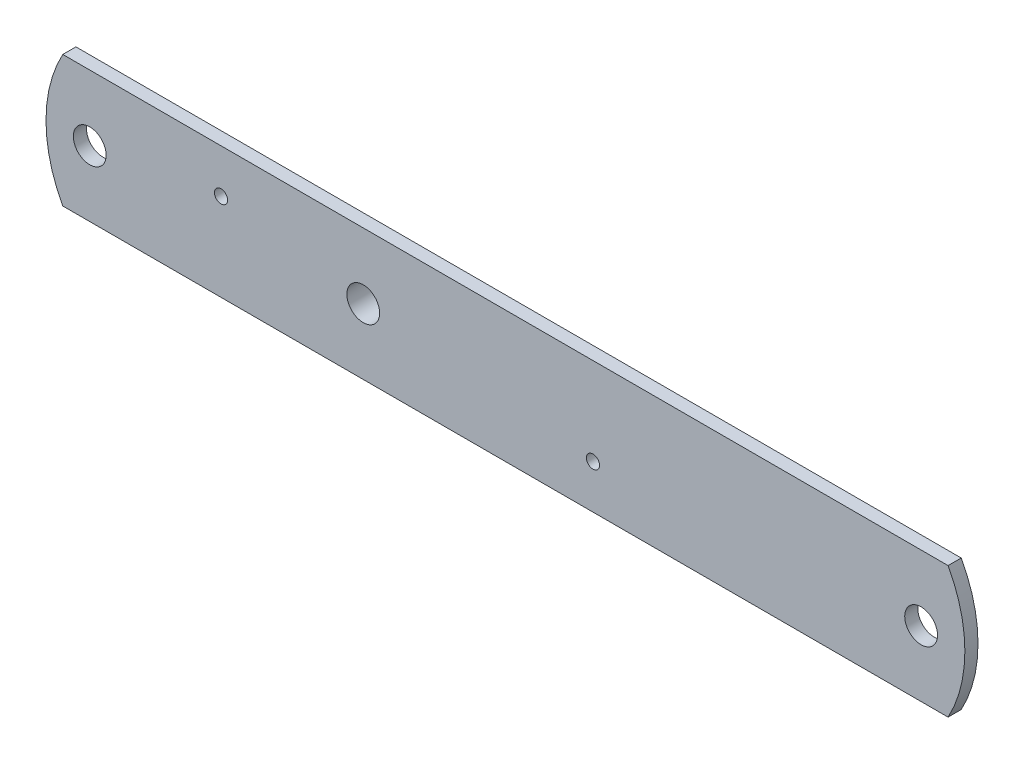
ISO-10303-21;
HEADER;
FILE_DESCRIPTION(('STEP AP214'),'2;1');
FILE_NAME('part.step','',(''),(''),'','','');
FILE_SCHEMA(('AUTOMOTIVE_DESIGN { 1 0 10303 214 1 1 1 1 }'));
ENDSEC;
DATA;
#1=APPLICATION_CONTEXT('core data for automotive mechanical design processes');
#2=APPLICATION_PROTOCOL_DEFINITION('international standard','automotive_design',2000,#1);
#3=PRODUCT_CONTEXT('',#1,'mechanical');
#4=PRODUCT('Part','Part','',(#3));
#5=PRODUCT_RELATED_PRODUCT_CATEGORY('part','',(#4));
#6=PRODUCT_DEFINITION_FORMATION('','',#4);
#7=PRODUCT_DEFINITION_CONTEXT('part definition',#1,'design');
#8=PRODUCT_DEFINITION('design','',#6,#7);
#9=PRODUCT_DEFINITION_SHAPE('','',#8);
#10=(LENGTH_UNIT() NAMED_UNIT(*) SI_UNIT(.MILLI.,.METRE.));
#11=(NAMED_UNIT(*) PLANE_ANGLE_UNIT() SI_UNIT($,.RADIAN.));
#12=(NAMED_UNIT(*) SI_UNIT($,.STERADIAN.) SOLID_ANGLE_UNIT());
#13=UNCERTAINTY_MEASURE_WITH_UNIT(LENGTH_MEASURE(1.E-05),#10,'distance_accuracy_value','');
#14=(GEOMETRIC_REPRESENTATION_CONTEXT(3) GLOBAL_UNCERTAINTY_ASSIGNED_CONTEXT((#13)) GLOBAL_UNIT_ASSIGNED_CONTEXT((#10,
#11,#12)) REPRESENTATION_CONTEXT('',''));
#15=CARTESIAN_POINT('',(0.,0.,0.));
#16=DIRECTION('',(0.,0.,1.));
#17=DIRECTION('',(1.,0.,0.));
#18=AXIS2_PLACEMENT_3D('',#15,#16,#17);
#19=CARTESIAN_POINT('',(125.,-59.9999999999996,0.));
#20=DIRECTION('',(0.,0.,1.));
#21=DIRECTION('',(1.,0.,0.));
#22=AXIS2_PLACEMENT_3D('',#19,#20,#21);
#23=PLANE('',#22);
#24=CARTESIAN_POINT('',(500.,-80.0000000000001,0.));
#25=DIRECTION('',(0.,0.,1.));
#26=DIRECTION('',(1.,0.,0.));
#27=AXIS2_PLACEMENT_3D('',#24,#25,#26);
#28=CIRCLE('',#27,5.99999999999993);
#29=CARTESIAN_POINT('',(494.,-80.0000000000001,0.));
#30=VERTEX_POINT('',#29);
#31=EDGE_CURVE('E127',#30,#30,#28,.T.);
#32=ORIENTED_EDGE('',*,*,#31,.T.);
#33=EDGE_LOOP('',(#32));
#34=FACE_BOUND('',#33,.T.);
#35=CARTESIAN_POINT('',(39.9999999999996,-59.9999999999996,0.));
#36=DIRECTION('',(0.,0.,1.));
#37=DIRECTION('',(1.,0.,0.));
#38=AXIS2_PLACEMENT_3D('',#35,#36,#37);
#39=CIRCLE('',#38,15.);
#40=CARTESIAN_POINT('',(24.9999999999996,-59.9999999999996,0.));
#41=VERTEX_POINT('',#40);
#42=EDGE_CURVE('E148',#41,#41,#39,.T.);
#43=ORIENTED_EDGE('',*,*,#42,.T.);
#44=EDGE_LOOP('',(#43));
#45=FACE_BOUND('',#44,.T.);
#46=CARTESIAN_POINT('',(125.,-59.9999999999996,0.));
#47=DIRECTION('',(0.,0.,1.));
#48=DIRECTION('',(1.,0.,0.));
#49=AXIS2_PLACEMENT_3D('',#46,#47,#48);
#50=CIRCLE('',#49,125.);
#51=CARTESIAN_POINT('',(15.3414390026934,0.,0.));
#52=VERTEX_POINT('',#51);
#53=CARTESIAN_POINT('',(15.3414390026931,-120.000000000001,0.));
#54=VERTEX_POINT('',#53);
#55=EDGE_CURVE('E154',#52,#54,#50,.T.);
#56=ORIENTED_EDGE('',*,*,#55,.F.);
#57=DIRECTION('',(-1.,0.,0.));
#58=VECTOR('',#57,1.);
#59=CARTESIAN_POINT('',(15.3414390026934,0.,0.));
#60=LINE('',#59,#58);
#61=CARTESIAN_POINT('',(824.658560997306,0.,0.));
#62=VERTEX_POINT('',#61);
#63=EDGE_CURVE('E161',#62,#52,#60,.T.);
#64=ORIENTED_EDGE('',*,*,#63,.F.);
#65=CARTESIAN_POINT('',(715.,-59.9999999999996,0.));
#66=DIRECTION('',(0.,0.,1.));
#67=DIRECTION('',(1.,0.,0.));
#68=AXIS2_PLACEMENT_3D('',#65,#66,#67);
#69=CIRCLE('',#68,125.);
#70=CARTESIAN_POINT('',(824.658560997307,-120.,0.));
#71=VERTEX_POINT('',#70);
#72=EDGE_CURVE('E159',#71,#62,#69,.T.);
#73=ORIENTED_EDGE('',*,*,#72,.F.);
#74=DIRECTION('',(1.,0.,0.));
#75=VECTOR('',#74,1.);
#76=CARTESIAN_POINT('',(15.3414390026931,-120.000000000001,0.));
#77=LINE('',#76,#75);
#78=EDGE_CURVE('E157',#54,#71,#77,.T.);
#79=ORIENTED_EDGE('',*,*,#78,.F.);
#80=EDGE_LOOP('',(#56,#64,#73,#79));
#81=FACE_BOUND('',#80,.T.);
#82=CARTESIAN_POINT('',(160.,-40.,0.));
#83=DIRECTION('',(0.,0.,1.));
#84=DIRECTION('',(1.,0.,0.));
#85=AXIS2_PLACEMENT_3D('',#82,#83,#84);
#86=CIRCLE('',#85,6.00000000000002);
#87=CARTESIAN_POINT('',(154.,-40.,0.));
#88=VERTEX_POINT('',#87);
#89=EDGE_CURVE('E142',#88,#88,#86,.T.);
#90=ORIENTED_EDGE('',*,*,#89,.T.);
#91=EDGE_LOOP('',(#90));
#92=FACE_BOUND('',#91,.T.);
#93=CARTESIAN_POINT('',(800.,-59.9999999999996,0.));
#94=DIRECTION('',(0.,0.,1.));
#95=DIRECTION('',(1.,0.,0.));
#96=AXIS2_PLACEMENT_3D('',#93,#94,#95);
#97=CIRCLE('',#96,15.);
#98=CARTESIAN_POINT('',(785.,-59.9999999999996,0.));
#99=VERTEX_POINT('',#98);
#100=EDGE_CURVE('E133',#99,#99,#97,.T.);
#101=ORIENTED_EDGE('',*,*,#100,.T.);
#102=EDGE_LOOP('',(#101));
#103=FACE_BOUND('',#102,.T.);
#104=DIRECTION('',(0.,-1.,0.));
#105=VECTOR('',#104,1.);
#106=CARTESIAN_POINT('',(340.,-30.0000000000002,0.));
#107=LINE('',#106,#105);
#108=CARTESIAN_POINT('',(340.,-30.0000000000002,0.));
#109=VERTEX_POINT('',#108);
#110=CARTESIAN_POINT('',(340.,-90.0000000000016,0.));
#111=VERTEX_POINT('',#110);
#112=EDGE_CURVE('E94',#109,#111,#107,.T.);
#113=ORIENTED_EDGE('',*,*,#112,.F.);
#114=DIRECTION('',(1.,0.,0.));
#115=VECTOR('',#114,1.);
#116=CARTESIAN_POINT('',(340.,-30.0000000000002,0.));
#117=LINE('',#116,#115);
#118=CARTESIAN_POINT('',(240.,-30.0000000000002,0.));
#119=VERTEX_POINT('',#118);
#120=EDGE_CURVE('E96',#119,#109,#117,.T.);
#121=ORIENTED_EDGE('',*,*,#120,.F.);
#122=DIRECTION('',(0.,1.,0.));
#123=VECTOR('',#122,1.);
#124=CARTESIAN_POINT('',(240.,-30.0000000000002,0.));
#125=LINE('',#124,#123);
#126=CARTESIAN_POINT('',(240.,-90.0000000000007,0.));
#127=VERTEX_POINT('',#126);
#128=EDGE_CURVE('E53',#127,#119,#125,.T.);
#129=ORIENTED_EDGE('',*,*,#128,.F.);
#130=DIRECTION('',(-1.,0.,0.));
#131=VECTOR('',#130,1.);
#132=CARTESIAN_POINT('',(340.,-90.0000000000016,0.));
#133=LINE('',#132,#131);
#134=EDGE_CURVE('E48',#111,#127,#133,.T.);
#135=ORIENTED_EDGE('',*,*,#134,.F.);
#136=EDGE_LOOP('',(#113,#121,#129,#135));
#137=FACE_BOUND('',#136,.T.);
#138=ADVANCED_FACE('F33',(#34,#45,#81,#92,#103,#137),#23,.F.);
#139=CARTESIAN_POINT('',(125.,-59.9999999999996,12.));
#140=DIRECTION('',(0.,0.,1.));
#141=DIRECTION('',(1.,0.,0.));
#142=AXIS2_PLACEMENT_3D('',#139,#140,#141);
#143=PLANE('',#142);
#144=CARTESIAN_POINT('',(800.,-59.9999999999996,12.));
#145=DIRECTION('',(0.,0.,1.));
#146=DIRECTION('',(1.,0.,0.));
#147=AXIS2_PLACEMENT_3D('',#144,#145,#146);
#148=CIRCLE('',#147,15.);
#149=CARTESIAN_POINT('',(785.,-59.9999999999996,12.));
#150=VERTEX_POINT('',#149);
#151=EDGE_CURVE('E136',#150,#150,#148,.T.);
#152=ORIENTED_EDGE('',*,*,#151,.F.);
#153=EDGE_LOOP('',(#152));
#154=FACE_BOUND('',#153,.T.);
#155=CARTESIAN_POINT('',(160.,-40.,12.));
#156=DIRECTION('',(0.,0.,1.));
#157=DIRECTION('',(1.,0.,0.));
#158=AXIS2_PLACEMENT_3D('',#155,#156,#157);
#159=CIRCLE('',#158,6.00000000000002);
#160=CARTESIAN_POINT('',(154.,-40.,12.));
#161=VERTEX_POINT('',#160);
#162=EDGE_CURVE('E145',#161,#161,#159,.T.);
#163=ORIENTED_EDGE('',*,*,#162,.F.);
#164=EDGE_LOOP('',(#163));
#165=FACE_BOUND('',#164,.T.);
#166=CARTESIAN_POINT('',(125.,-59.9999999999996,12.));
#167=DIRECTION('',(0.,0.,1.));
#168=DIRECTION('',(1.,0.,0.));
#169=AXIS2_PLACEMENT_3D('',#166,#167,#168);
#170=CIRCLE('',#169,125.);
#171=CARTESIAN_POINT('',(15.3414390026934,0.,12.));
#172=VERTEX_POINT('',#171);
#173=CARTESIAN_POINT('',(15.3414390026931,-120.000000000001,12.));
#174=VERTEX_POINT('',#173);
#175=EDGE_CURVE('E163',#172,#174,#170,.T.);
#176=ORIENTED_EDGE('',*,*,#175,.T.);
#177=DIRECTION('',(1.,0.,0.));
#178=VECTOR('',#177,1.);
#179=CARTESIAN_POINT('',(15.3414390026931,-120.000000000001,12.));
#180=LINE('',#179,#178);
#181=CARTESIAN_POINT('',(824.658560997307,-120.,12.));
#182=VERTEX_POINT('',#181);
#183=EDGE_CURVE('E166',#174,#182,#180,.T.);
#184=ORIENTED_EDGE('',*,*,#183,.T.);
#185=CARTESIAN_POINT('',(715.,-59.9999999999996,12.));
#186=DIRECTION('',(0.,0.,1.));
#187=DIRECTION('',(1.,0.,0.));
#188=AXIS2_PLACEMENT_3D('',#185,#186,#187);
#189=CIRCLE('',#188,125.);
#190=CARTESIAN_POINT('',(824.658560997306,0.,12.));
#191=VERTEX_POINT('',#190);
#192=EDGE_CURVE('E168',#182,#191,#189,.T.);
#193=ORIENTED_EDGE('',*,*,#192,.T.);
#194=DIRECTION('',(-1.,0.,0.));
#195=VECTOR('',#194,1.);
#196=CARTESIAN_POINT('',(15.3414390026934,0.,12.));
#197=LINE('',#196,#195);
#198=EDGE_CURVE('E170',#191,#172,#197,.T.);
#199=ORIENTED_EDGE('',*,*,#198,.T.);
#200=EDGE_LOOP('',(#176,#184,#193,#199));
#201=FACE_BOUND('',#200,.T.);
#202=CARTESIAN_POINT('',(39.9999999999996,-59.9999999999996,12.));
#203=DIRECTION('',(0.,0.,1.));
#204=DIRECTION('',(1.,0.,0.));
#205=AXIS2_PLACEMENT_3D('',#202,#203,#204);
#206=CIRCLE('',#205,15.);
#207=CARTESIAN_POINT('',(24.9999999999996,-59.9999999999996,12.));
#208=VERTEX_POINT('',#207);
#209=EDGE_CURVE('E151',#208,#208,#206,.T.);
#210=ORIENTED_EDGE('',*,*,#209,.F.);
#211=EDGE_LOOP('',(#210));
#212=FACE_BOUND('',#211,.T.);
#213=CARTESIAN_POINT('',(290.,-59.9999999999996,12.));
#214=DIRECTION('',(0.,0.,1.));
#215=DIRECTION('',(1.,0.,0.));
#216=AXIS2_PLACEMENT_3D('',#213,#214,#215);
#217=CIRCLE('',#216,15.);
#218=CARTESIAN_POINT('',(275.,-59.9999999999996,12.));
#219=VERTEX_POINT('',#218);
#220=EDGE_CURVE('E139',#219,#219,#217,.T.);
#221=ORIENTED_EDGE('',*,*,#220,.F.);
#222=EDGE_LOOP('',(#221));
#223=FACE_BOUND('',#222,.T.);
#224=CARTESIAN_POINT('',(500.,-80.0000000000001,12.));
#225=DIRECTION('',(0.,0.,1.));
#226=DIRECTION('',(1.,0.,0.));
#227=AXIS2_PLACEMENT_3D('',#224,#225,#226);
#228=CIRCLE('',#227,5.99999999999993);
#229=CARTESIAN_POINT('',(494.,-80.0000000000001,12.));
#230=VERTEX_POINT('',#229);
#231=EDGE_CURVE('E130',#230,#230,#228,.T.);
#232=ORIENTED_EDGE('',*,*,#231,.F.);
#233=EDGE_LOOP('',(#232));
#234=FACE_BOUND('',#233,.T.);
#235=ADVANCED_FACE('F197',(#154,#165,#201,#212,#223,#234),#143,.T.);
#236=CARTESIAN_POINT('',(125.,-59.9999999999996,12.));
#237=DIRECTION('',(0.,0.,-1.));
#238=DIRECTION('',(-1.,0.,0.));
#239=AXIS2_PLACEMENT_3D('',#236,#237,#238);
#240=CYLINDRICAL_SURFACE('',#239,125.);
#241=ORIENTED_EDGE('',*,*,#55,.T.);
#242=DIRECTION('',(0.,0.,-1.));
#243=VECTOR('',#242,1.);
#244=CARTESIAN_POINT('',(15.3414390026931,-120.000000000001,12.));
#245=LINE('',#244,#243);
#246=EDGE_CURVE('E11',#174,#54,#245,.T.);
#247=ORIENTED_EDGE('',*,*,#246,.F.);
#248=ORIENTED_EDGE('',*,*,#175,.F.);
#249=DIRECTION('',(0.,0.,-1.));
#250=VECTOR('',#249,1.);
#251=CARTESIAN_POINT('',(15.3414390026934,0.,12.));
#252=LINE('',#251,#250);
#253=EDGE_CURVE('E172',#172,#52,#252,.T.);
#254=ORIENTED_EDGE('',*,*,#253,.T.);
#255=EDGE_LOOP('',(#241,#247,#248,#254));
#256=FACE_BOUND('',#255,.T.);
#257=ADVANCED_FACE('F35',(#256),#240,.T.);
#258=CARTESIAN_POINT('',(15.3414390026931,-120.000000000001,12.));
#259=DIRECTION('',(0.,1.,0.));
#260=DIRECTION('',(0.,0.,1.));
#261=AXIS2_PLACEMENT_3D('',#258,#259,#260);
#262=PLANE('',#261);
#263=ORIENTED_EDGE('',*,*,#78,.T.);
#264=DIRECTION('',(0.,0.,-1.));
#265=VECTOR('',#264,1.);
#266=CARTESIAN_POINT('',(824.658560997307,-120.,12.));
#267=LINE('',#266,#265);
#268=EDGE_CURVE('E41',#182,#71,#267,.T.);
#269=ORIENTED_EDGE('',*,*,#268,.F.);
#270=ORIENTED_EDGE('',*,*,#183,.F.);
#271=ORIENTED_EDGE('',*,*,#246,.T.);
#272=EDGE_LOOP('',(#263,#269,#270,#271));
#273=FACE_BOUND('',#272,.T.);
#274=ADVANCED_FACE('F199',(#273),#262,.F.);
#275=CARTESIAN_POINT('',(715.,-59.9999999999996,12.));
#276=DIRECTION('',(0.,0.,-1.));
#277=DIRECTION('',(-1.,0.,0.));
#278=AXIS2_PLACEMENT_3D('',#275,#276,#277);
#279=CYLINDRICAL_SURFACE('',#278,125.);
#280=ORIENTED_EDGE('',*,*,#72,.T.);
#281=DIRECTION('',(0.,0.,-1.));
#282=VECTOR('',#281,1.);
#283=CARTESIAN_POINT('',(824.658560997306,0.,12.));
#284=LINE('',#283,#282);
#285=EDGE_CURVE('E175',#191,#62,#284,.T.);
#286=ORIENTED_EDGE('',*,*,#285,.F.);
#287=ORIENTED_EDGE('',*,*,#192,.F.);
#288=ORIENTED_EDGE('',*,*,#268,.T.);
#289=EDGE_LOOP('',(#280,#286,#287,#288));
#290=FACE_BOUND('',#289,.T.);
#291=ADVANCED_FACE('F182',(#290),#279,.T.);
#292=CARTESIAN_POINT('',(15.3414390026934,0.,12.));
#293=DIRECTION('',(0.,-1.,0.));
#294=DIRECTION('',(0.,0.,-1.));
#295=AXIS2_PLACEMENT_3D('',#292,#293,#294);
#296=PLANE('',#295);
#297=ORIENTED_EDGE('',*,*,#63,.T.);
#298=ORIENTED_EDGE('',*,*,#253,.F.);
#299=ORIENTED_EDGE('',*,*,#198,.F.);
#300=ORIENTED_EDGE('',*,*,#285,.T.);
#301=EDGE_LOOP('',(#297,#298,#299,#300));
#302=FACE_BOUND('',#301,.T.);
#303=ADVANCED_FACE('F191',(#302),#296,.F.);
#304=CARTESIAN_POINT('',(39.9999999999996,-59.9999999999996,12.));
#305=DIRECTION('',(0.,0.,-1.));
#306=DIRECTION('',(-1.,0.,0.));
#307=AXIS2_PLACEMENT_3D('',#304,#305,#306);
#308=CYLINDRICAL_SURFACE('',#307,15.);
#309=CARTESIAN_POINT('',(24.9999999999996,-59.9999999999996,12.));
#310=CARTESIAN_POINT('',(24.9999999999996,-59.9999999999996,11.875));
#311=CARTESIAN_POINT('',(24.9999999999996,-59.9999999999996,11.75));
#312=CARTESIAN_POINT('',(24.9999999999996,-59.9999999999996,11.5));
#313=CARTESIAN_POINT('',(24.9999999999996,-59.9999999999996,11.375));
#314=CARTESIAN_POINT('',(24.9999999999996,-59.9999999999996,11.125));
#315=CARTESIAN_POINT('',(24.9999999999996,-59.9999999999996,11.));
#316=CARTESIAN_POINT('',(24.9999999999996,-59.9999999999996,10.75));
#317=CARTESIAN_POINT('',(24.9999999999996,-59.9999999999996,10.625));
#318=CARTESIAN_POINT('',(24.9999999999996,-59.9999999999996,10.375));
#319=CARTESIAN_POINT('',(24.9999999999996,-59.9999999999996,10.25));
#320=CARTESIAN_POINT('',(24.9999999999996,-59.9999999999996,9.99999999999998));
#321=CARTESIAN_POINT('',(24.9999999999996,-59.9999999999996,9.87499999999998));
#322=CARTESIAN_POINT('',(24.9999999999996,-59.9999999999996,9.62499999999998));
#323=CARTESIAN_POINT('',(24.9999999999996,-59.9999999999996,9.49999999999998));
#324=CARTESIAN_POINT('',(24.9999999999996,-59.9999999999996,9.24999999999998));
#325=CARTESIAN_POINT('',(24.9999999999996,-59.9999999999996,9.12499999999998));
#326=CARTESIAN_POINT('',(24.9999999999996,-59.9999999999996,8.87499999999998));
#327=CARTESIAN_POINT('',(24.9999999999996,-59.9999999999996,8.74999999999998));
#328=CARTESIAN_POINT('',(24.9999999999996,-59.9999999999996,8.49999999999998));
#329=CARTESIAN_POINT('',(24.9999999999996,-59.9999999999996,8.37499999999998));
#330=CARTESIAN_POINT('',(24.9999999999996,-59.9999999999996,8.12499999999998));
#331=CARTESIAN_POINT('',(24.9999999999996,-59.9999999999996,7.99999999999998));
#332=CARTESIAN_POINT('',(24.9999999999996,-59.9999999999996,7.74999999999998));
#333=CARTESIAN_POINT('',(24.9999999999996,-59.9999999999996,7.62499999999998));
#334=CARTESIAN_POINT('',(24.9999999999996,-59.9999999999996,7.37499999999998));
#335=CARTESIAN_POINT('',(24.9999999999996,-59.9999999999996,7.24999999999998));
#336=CARTESIAN_POINT('',(24.9999999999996,-59.9999999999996,6.99999999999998));
#337=CARTESIAN_POINT('',(24.9999999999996,-59.9999999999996,6.87499999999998));
#338=CARTESIAN_POINT('',(24.9999999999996,-59.9999999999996,6.62499999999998));
#339=CARTESIAN_POINT('',(24.9999999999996,-59.9999999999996,6.49999999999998));
#340=CARTESIAN_POINT('',(24.9999999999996,-59.9999999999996,6.24999999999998));
#341=CARTESIAN_POINT('',(24.9999999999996,-59.9999999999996,6.12499999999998));
#342=CARTESIAN_POINT('',(24.9999999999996,-59.9999999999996,5.87499999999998));
#343=CARTESIAN_POINT('',(24.9999999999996,-59.9999999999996,5.74999999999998));
#344=CARTESIAN_POINT('',(24.9999999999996,-59.9999999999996,5.49999999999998));
#345=CARTESIAN_POINT('',(24.9999999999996,-59.9999999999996,5.37499999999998));
#346=CARTESIAN_POINT('',(24.9999999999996,-59.9999999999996,5.12499999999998));
#347=CARTESIAN_POINT('',(24.9999999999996,-59.9999999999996,4.99999999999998));
#348=CARTESIAN_POINT('',(24.9999999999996,-59.9999999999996,4.74999999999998));
#349=CARTESIAN_POINT('',(24.9999999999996,-59.9999999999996,4.62499999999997));
#350=CARTESIAN_POINT('',(24.9999999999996,-59.9999999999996,4.37499999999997));
#351=CARTESIAN_POINT('',(24.9999999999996,-59.9999999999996,4.24999999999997));
#352=CARTESIAN_POINT('',(24.9999999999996,-59.9999999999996,3.99999999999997));
#353=CARTESIAN_POINT('',(24.9999999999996,-59.9999999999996,3.87499999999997));
#354=CARTESIAN_POINT('',(24.9999999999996,-59.9999999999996,3.62499999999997));
#355=CARTESIAN_POINT('',(24.9999999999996,-59.9999999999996,3.49999999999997));
#356=CARTESIAN_POINT('',(24.9999999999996,-59.9999999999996,3.24999999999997));
#357=CARTESIAN_POINT('',(24.9999999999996,-59.9999999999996,3.12499999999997));
#358=CARTESIAN_POINT('',(24.9999999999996,-59.9999999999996,2.87499999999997));
#359=CARTESIAN_POINT('',(24.9999999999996,-59.9999999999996,2.74999999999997));
#360=CARTESIAN_POINT('',(24.9999999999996,-59.9999999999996,2.49999999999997));
#361=CARTESIAN_POINT('',(24.9999999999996,-59.9999999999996,2.37499999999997));
#362=CARTESIAN_POINT('',(24.9999999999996,-59.9999999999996,2.12499999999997));
#363=CARTESIAN_POINT('',(24.9999999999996,-59.9999999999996,1.99999999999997));
#364=CARTESIAN_POINT('',(24.9999999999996,-59.9999999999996,1.74999999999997));
#365=CARTESIAN_POINT('',(24.9999999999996,-59.9999999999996,1.62499999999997));
#366=CARTESIAN_POINT('',(24.9999999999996,-59.9999999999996,1.37499999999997));
#367=CARTESIAN_POINT('',(24.9999999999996,-59.9999999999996,1.24999999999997));
#368=CARTESIAN_POINT('',(24.9999999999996,-59.9999999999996,0.999999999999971));
#369=CARTESIAN_POINT('',(24.9999999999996,-59.9999999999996,0.874999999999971));
#370=CARTESIAN_POINT('',(24.9999999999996,-59.9999999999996,0.624999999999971));
#371=CARTESIAN_POINT('',(24.9999999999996,-59.9999999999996,0.499999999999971));
#372=CARTESIAN_POINT('',(24.9999999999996,-59.9999999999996,0.249999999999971));
#373=CARTESIAN_POINT('',(24.9999999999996,-59.9999999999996,0.124999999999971));
#374=CARTESIAN_POINT('',(24.9999999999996,-59.9999999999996,0.));
#375=B_SPLINE_CURVE_WITH_KNOTS('',3,(#309,#310,#311,#312,#313,#314,#315,#316,#317,#318,#319,
#320,#321,#322,#323,#324,#325,#326,#327,#328,#329,#330,#331,#332,#333,#334,#335,#336,#337,#338,
#339,#340,#341,#342,#343,#344,#345,#346,#347,#348,#349,#350,#351,#352,#353,#354,#355,#356,#357,
#358,#359,#360,#361,#362,#363,#364,#365,#366,#367,#368,#369,#370,#371,#372,#373,#374),
.UNSPECIFIED.,.F.,.F.,(4,2,2,2,2,2,2,2,2,2,2,2,2,2,2,2,2,2,2,2,2,2,2,2,2,2,2,2,2,2,2,2,4),(0.,
0.375000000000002,0.750000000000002,1.125,1.5,1.875,2.25,2.625,3.,3.375,3.75,4.12500000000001,
4.50000000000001,4.87500000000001,5.25000000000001,5.62500000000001,6.00000000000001,
6.37500000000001,6.75000000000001,7.12500000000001,7.50000000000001,7.87500000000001,
8.25000000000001,8.62500000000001,9.00000000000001,9.37500000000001,9.75000000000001,10.125,
10.5,10.875,11.25,11.625,12.),.UNSPECIFIED.);
#376=EDGE_CURVE('BSEAM216',#208,#41,#375,.T.);
#377=ORIENTED_EDGE('',*,*,#209,.T.);
#378=ORIENTED_EDGE('',*,*,#42,.F.);
#379=ORIENTED_EDGE('',*,*,#376,.T.);
#380=ORIENTED_EDGE('',*,*,#376,.F.);
#381=EDGE_LOOP('',(#377,#379,#378,#380));
#382=FACE_BOUND('',#381,.T.);
#383=ADVANCED_FACE('F216',(#382),#308,.F.);
#384=CARTESIAN_POINT('',(160.,-40.,12.));
#385=DIRECTION('',(0.,0.,-1.));
#386=DIRECTION('',(-1.,0.,0.));
#387=AXIS2_PLACEMENT_3D('',#384,#385,#386);
#388=CYLINDRICAL_SURFACE('',#387,6.00000000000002);
#389=CARTESIAN_POINT('',(154.,-40.,12.));
#390=CARTESIAN_POINT('',(154.,-40.,11.875));
#391=CARTESIAN_POINT('',(154.,-40.,11.75));
#392=CARTESIAN_POINT('',(154.,-40.,11.5));
#393=CARTESIAN_POINT('',(154.,-40.,11.375));
#394=CARTESIAN_POINT('',(154.,-40.,11.125));
#395=CARTESIAN_POINT('',(154.,-40.,11.));
#396=CARTESIAN_POINT('',(154.,-40.,10.75));
#397=CARTESIAN_POINT('',(154.,-40.,10.625));
#398=CARTESIAN_POINT('',(154.,-40.,10.375));
#399=CARTESIAN_POINT('',(154.,-40.,10.25));
#400=CARTESIAN_POINT('',(154.,-40.,9.99999999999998));
#401=CARTESIAN_POINT('',(154.,-40.,9.87499999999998));
#402=CARTESIAN_POINT('',(154.,-40.,9.62499999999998));
#403=CARTESIAN_POINT('',(154.,-40.,9.49999999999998));
#404=CARTESIAN_POINT('',(154.,-40.,9.24999999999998));
#405=CARTESIAN_POINT('',(154.,-40.,9.12499999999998));
#406=CARTESIAN_POINT('',(154.,-40.,8.87499999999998));
#407=CARTESIAN_POINT('',(154.,-40.,8.74999999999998));
#408=CARTESIAN_POINT('',(154.,-40.,8.49999999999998));
#409=CARTESIAN_POINT('',(154.,-40.,8.37499999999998));
#410=CARTESIAN_POINT('',(154.,-40.,8.12499999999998));
#411=CARTESIAN_POINT('',(154.,-40.,7.99999999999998));
#412=CARTESIAN_POINT('',(154.,-40.,7.74999999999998));
#413=CARTESIAN_POINT('',(154.,-40.,7.62499999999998));
#414=CARTESIAN_POINT('',(154.,-40.,7.37499999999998));
#415=CARTESIAN_POINT('',(154.,-40.,7.24999999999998));
#416=CARTESIAN_POINT('',(154.,-40.,6.99999999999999));
#417=CARTESIAN_POINT('',(154.,-40.,6.87499999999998));
#418=CARTESIAN_POINT('',(154.,-40.,6.62499999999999));
#419=CARTESIAN_POINT('',(154.,-40.,6.49999999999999));
#420=CARTESIAN_POINT('',(154.,-40.,6.24999999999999));
#421=CARTESIAN_POINT('',(154.,-40.,6.12499999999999));
#422=CARTESIAN_POINT('',(154.,-40.,5.87499999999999));
#423=CARTESIAN_POINT('',(154.,-40.,5.74999999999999));
#424=CARTESIAN_POINT('',(154.,-40.,5.49999999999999));
#425=CARTESIAN_POINT('',(154.,-40.,5.37499999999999));
#426=CARTESIAN_POINT('',(154.,-40.,5.12499999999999));
#427=CARTESIAN_POINT('',(154.,-40.,4.99999999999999));
#428=CARTESIAN_POINT('',(154.,-40.,4.74999999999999));
#429=CARTESIAN_POINT('',(154.,-40.,4.62499999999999));
#430=CARTESIAN_POINT('',(154.,-40.,4.37499999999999));
#431=CARTESIAN_POINT('',(154.,-40.,4.24999999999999));
#432=CARTESIAN_POINT('',(154.,-40.,3.99999999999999));
#433=CARTESIAN_POINT('',(154.,-40.,3.87499999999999));
#434=CARTESIAN_POINT('',(154.,-40.,3.62499999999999));
#435=CARTESIAN_POINT('',(154.,-40.,3.49999999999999));
#436=CARTESIAN_POINT('',(154.,-40.,3.24999999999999));
#437=CARTESIAN_POINT('',(154.,-40.,3.12499999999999));
#438=CARTESIAN_POINT('',(154.,-40.,2.87499999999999));
#439=CARTESIAN_POINT('',(154.,-40.,2.74999999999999));
#440=CARTESIAN_POINT('',(154.,-40.,2.49999999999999));
#441=CARTESIAN_POINT('',(154.,-40.,2.37499999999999));
#442=CARTESIAN_POINT('',(154.,-40.,2.12499999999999));
#443=CARTESIAN_POINT('',(154.,-40.,1.99999999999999));
#444=CARTESIAN_POINT('',(154.,-40.,1.75));
#445=CARTESIAN_POINT('',(154.,-40.,1.625));
#446=CARTESIAN_POINT('',(154.,-40.,1.375));
#447=CARTESIAN_POINT('',(154.,-40.,1.25));
#448=CARTESIAN_POINT('',(154.,-40.,0.999999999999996));
#449=CARTESIAN_POINT('',(154.,-40.,0.874999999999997));
#450=CARTESIAN_POINT('',(154.,-40.,0.624999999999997));
#451=CARTESIAN_POINT('',(154.,-40.,0.499999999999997));
#452=CARTESIAN_POINT('',(154.,-40.,0.249999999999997));
#453=CARTESIAN_POINT('',(154.,-40.,0.124999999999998));
#454=CARTESIAN_POINT('',(154.,-40.,0.));
#455=B_SPLINE_CURVE_WITH_KNOTS('',3,(#389,#390,#391,#392,#393,#394,#395,#396,#397,#398,#399,
#400,#401,#402,#403,#404,#405,#406,#407,#408,#409,#410,#411,#412,#413,#414,#415,#416,#417,#418,
#419,#420,#421,#422,#423,#424,#425,#426,#427,#428,#429,#430,#431,#432,#433,#434,#435,#436,#437,
#438,#439,#440,#441,#442,#443,#444,#445,#446,#447,#448,#449,#450,#451,#452,#453,#454),
.UNSPECIFIED.,.F.,.F.,(4,2,2,2,2,2,2,2,2,2,2,2,2,2,2,2,2,2,2,2,2,2,2,2,2,2,2,2,2,2,2,2,4),(0.,
0.374999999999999,0.749999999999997,1.125,1.5,1.87499999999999,2.25,2.62499999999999,
2.99999999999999,3.37499999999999,3.74999999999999,4.12499999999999,4.49999999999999,
4.87499999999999,5.24999999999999,5.62499999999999,5.99999999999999,6.37499999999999,
6.74999999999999,7.12499999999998,7.49999999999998,7.87499999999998,8.24999999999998,
8.62499999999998,8.99999999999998,9.37499999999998,9.74999999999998,10.125,10.5,10.875,11.25,
11.625,12.),.UNSPECIFIED.);
#456=EDGE_CURVE('BSEAM223',#161,#88,#455,.T.);
#457=ORIENTED_EDGE('',*,*,#162,.T.);
#458=ORIENTED_EDGE('',*,*,#89,.F.);
#459=ORIENTED_EDGE('',*,*,#456,.T.);
#460=ORIENTED_EDGE('',*,*,#456,.F.);
#461=EDGE_LOOP('',(#457,#459,#458,#460));
#462=FACE_BOUND('',#461,.T.);
#463=ADVANCED_FACE('F223',(#462),#388,.F.);
#464=CARTESIAN_POINT('',(290.,-59.9999999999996,12.));
#465=DIRECTION('',(0.,0.,-1.));
#466=DIRECTION('',(-1.,0.,0.));
#467=AXIS2_PLACEMENT_3D('',#464,#465,#466);
#468=CYLINDRICAL_SURFACE('',#467,15.);
#469=CARTESIAN_POINT('',(290.,-59.9999999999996,-10.));
#470=DIRECTION('',(0.,0.,-1.));
#471=DIRECTION('',(-1.,0.,0.));
#472=AXIS2_PLACEMENT_3D('',#469,#470,#471);
#473=CIRCLE('',#472,15.);
#474=CARTESIAN_POINT('',(275.,-59.9999999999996,-10.));
#475=VERTEX_POINT('',#474);
#476=EDGE_CURVE('E100',#475,#475,#473,.T.);
#477=CARTESIAN_POINT('',(275.,-59.9999999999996,12.));
#478=CARTESIAN_POINT('',(275.,-59.9999999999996,11.7708333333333));
#479=CARTESIAN_POINT('',(275.,-59.9999999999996,11.5416666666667));
#480=CARTESIAN_POINT('',(275.,-59.9999999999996,11.0833333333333));
#481=CARTESIAN_POINT('',(275.,-59.9999999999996,10.8541666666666));
#482=CARTESIAN_POINT('',(275.,-59.9999999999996,10.3958333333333));
#483=CARTESIAN_POINT('',(275.,-59.9999999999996,10.1666666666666));
#484=CARTESIAN_POINT('',(275.,-59.9999999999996,9.70833333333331));
#485=CARTESIAN_POINT('',(275.,-59.9999999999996,9.47916666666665));
#486=CARTESIAN_POINT('',(275.,-59.9999999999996,9.02083333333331));
#487=CARTESIAN_POINT('',(275.,-59.9999999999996,8.79166666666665));
#488=CARTESIAN_POINT('',(275.,-59.9999999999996,8.33333333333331));
#489=CARTESIAN_POINT('',(275.,-59.9999999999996,8.10416666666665));
#490=CARTESIAN_POINT('',(275.,-59.9999999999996,7.64583333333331));
#491=CARTESIAN_POINT('',(275.,-59.9999999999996,7.41666666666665));
#492=CARTESIAN_POINT('',(275.,-59.9999999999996,6.95833333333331));
#493=CARTESIAN_POINT('',(275.,-59.9999999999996,6.72916666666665));
#494=CARTESIAN_POINT('',(275.,-59.9999999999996,6.27083333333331));
#495=CARTESIAN_POINT('',(275.,-59.9999999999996,6.04166666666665));
#496=CARTESIAN_POINT('',(275.,-59.9999999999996,5.58333333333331));
#497=CARTESIAN_POINT('',(275.,-59.9999999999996,5.35416666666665));
#498=CARTESIAN_POINT('',(275.,-59.9999999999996,4.89583333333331));
#499=CARTESIAN_POINT('',(275.,-59.9999999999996,4.66666666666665));
#500=CARTESIAN_POINT('',(275.,-59.9999999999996,4.20833333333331));
#501=CARTESIAN_POINT('',(275.,-59.9999999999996,3.97916666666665));
#502=CARTESIAN_POINT('',(275.,-59.9999999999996,3.52083333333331));
#503=CARTESIAN_POINT('',(275.,-59.9999999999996,3.29166666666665));
#504=CARTESIAN_POINT('',(275.,-59.9999999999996,2.83333333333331));
#505=CARTESIAN_POINT('',(275.,-59.9999999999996,2.60416666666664));
#506=CARTESIAN_POINT('',(275.,-59.9999999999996,2.14583333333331));
#507=CARTESIAN_POINT('',(275.,-59.9999999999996,1.91666666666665));
#508=CARTESIAN_POINT('',(275.,-59.9999999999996,1.45833333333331));
#509=CARTESIAN_POINT('',(275.,-59.9999999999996,1.22916666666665));
#510=CARTESIAN_POINT('',(275.,-59.9999999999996,0.770833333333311));
#511=CARTESIAN_POINT('',(275.,-59.9999999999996,0.541666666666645));
#512=CARTESIAN_POINT('',(275.,-59.9999999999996,0.0833333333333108));
#513=CARTESIAN_POINT('',(275.,-59.9999999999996,-0.145833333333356));
#514=CARTESIAN_POINT('',(275.,-59.9999999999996,-0.60416666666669));
#515=CARTESIAN_POINT('',(275.,-59.9999999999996,-0.833333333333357));
#516=CARTESIAN_POINT('',(275.,-59.9999999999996,-1.29166666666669));
#517=CARTESIAN_POINT('',(275.,-59.9999999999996,-1.52083333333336));
#518=CARTESIAN_POINT('',(275.,-59.9999999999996,-1.97916666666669));
#519=CARTESIAN_POINT('',(275.,-59.9999999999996,-2.20833333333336));
#520=CARTESIAN_POINT('',(275.,-59.9999999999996,-2.66666666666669));
#521=CARTESIAN_POINT('',(275.,-59.9999999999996,-2.89583333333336));
#522=CARTESIAN_POINT('',(275.,-59.9999999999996,-3.35416666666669));
#523=CARTESIAN_POINT('',(275.,-59.9999999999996,-3.58333333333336));
#524=CARTESIAN_POINT('',(275.,-59.9999999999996,-4.04166666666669));
#525=CARTESIAN_POINT('',(275.,-59.9999999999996,-4.27083333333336));
#526=CARTESIAN_POINT('',(275.,-59.9999999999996,-4.72916666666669));
#527=CARTESIAN_POINT('',(275.,-59.9999999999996,-4.95833333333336));
#528=CARTESIAN_POINT('',(275.,-59.9999999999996,-5.41666666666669));
#529=CARTESIAN_POINT('',(275.,-59.9999999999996,-5.64583333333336));
#530=CARTESIAN_POINT('',(275.,-59.9999999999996,-6.10416666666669));
#531=CARTESIAN_POINT('',(275.,-59.9999999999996,-6.33333333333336));
#532=CARTESIAN_POINT('',(275.,-59.9999999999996,-6.79166666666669));
#533=CARTESIAN_POINT('',(275.,-59.9999999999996,-7.02083333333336));
#534=CARTESIAN_POINT('',(275.,-59.9999999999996,-7.47916666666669));
#535=CARTESIAN_POINT('',(275.,-59.9999999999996,-7.70833333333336));
#536=CARTESIAN_POINT('',(275.,-59.9999999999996,-8.16666666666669));
#537=CARTESIAN_POINT('',(275.,-59.9999999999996,-8.39583333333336));
#538=CARTESIAN_POINT('',(275.,-59.9999999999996,-8.85416666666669));
#539=CARTESIAN_POINT('',(275.,-59.9999999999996,-9.08333333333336));
#540=CARTESIAN_POINT('',(275.,-59.9999999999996,-9.54166666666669));
#541=CARTESIAN_POINT('',(275.,-59.9999999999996,-9.77083333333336));
#542=CARTESIAN_POINT('',(275.,-59.9999999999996,-10.));
#543=B_SPLINE_CURVE_WITH_KNOTS('',3,(#477,#478,#479,#480,#481,#482,#483,#484,#485,#486,#487,
#488,#489,#490,#491,#492,#493,#494,#495,#496,#497,#498,#499,#500,#501,#502,#503,#504,#505,#506,
#507,#508,#509,#510,#511,#512,#513,#514,#515,#516,#517,#518,#519,#520,#521,#522,#523,#524,#525,
#526,#527,#528,#529,#530,#531,#532,#533,#534,#535,#536,#537,#538,#539,#540,#541,#542),
.UNSPECIFIED.,.F.,.F.,(4,2,2,2,2,2,2,2,2,2,2,2,2,2,2,2,2,2,2,2,2,2,2,2,2,2,2,2,2,2,2,2,4),(0.,
0.687500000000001,1.375,2.0625,2.75,3.4375,4.125,4.8125,5.5,6.1875,6.875,7.5625,8.25,
8.93750000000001,9.62500000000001,10.3125,11.,11.6875,12.375,13.0625,13.75,14.4375,15.125,
15.8125,16.5,17.1875,17.875,18.5625,19.25,19.9375,20.625,21.3125,22.),.UNSPECIFIED.);
#544=EDGE_CURVE('BSEAM228',#219,#475,#543,.T.);
#545=ORIENTED_EDGE('',*,*,#220,.T.);
#546=ORIENTED_EDGE('',*,*,#476,.T.);
#547=ORIENTED_EDGE('',*,*,#544,.T.);
#548=ORIENTED_EDGE('',*,*,#544,.F.);
#549=EDGE_LOOP('',(#545,#547,#546,#548));
#550=FACE_BOUND('',#549,.T.);
#551=ADVANCED_FACE('F228',(#550),#468,.F.);
#552=CARTESIAN_POINT('',(800.,-59.9999999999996,12.));
#553=DIRECTION('',(0.,0.,-1.));
#554=DIRECTION('',(-1.,0.,0.));
#555=AXIS2_PLACEMENT_3D('',#552,#553,#554);
#556=CYLINDRICAL_SURFACE('',#555,15.);
#557=CARTESIAN_POINT('',(785.,-59.9999999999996,12.));
#558=CARTESIAN_POINT('',(785.,-59.9999999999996,11.875));
#559=CARTESIAN_POINT('',(785.,-59.9999999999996,11.75));
#560=CARTESIAN_POINT('',(785.,-59.9999999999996,11.5));
#561=CARTESIAN_POINT('',(785.,-59.9999999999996,11.375));
#562=CARTESIAN_POINT('',(785.,-59.9999999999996,11.125));
#563=CARTESIAN_POINT('',(785.,-59.9999999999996,11.));
#564=CARTESIAN_POINT('',(785.,-59.9999999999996,10.75));
#565=CARTESIAN_POINT('',(785.,-59.9999999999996,10.625));
#566=CARTESIAN_POINT('',(785.,-59.9999999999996,10.375));
#567=CARTESIAN_POINT('',(785.,-59.9999999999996,10.25));
#568=CARTESIAN_POINT('',(785.,-59.9999999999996,9.99999999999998));
#569=CARTESIAN_POINT('',(785.,-59.9999999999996,9.87499999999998));
#570=CARTESIAN_POINT('',(785.,-59.9999999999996,9.62499999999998));
#571=CARTESIAN_POINT('',(785.,-59.9999999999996,9.49999999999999));
#572=CARTESIAN_POINT('',(785.,-59.9999999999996,9.24999999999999));
#573=CARTESIAN_POINT('',(785.,-59.9999999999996,9.12499999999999));
#574=CARTESIAN_POINT('',(785.,-59.9999999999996,8.87499999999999));
#575=CARTESIAN_POINT('',(785.,-59.9999999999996,8.74999999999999));
#576=CARTESIAN_POINT('',(785.,-59.9999999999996,8.49999999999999));
#577=CARTESIAN_POINT('',(785.,-59.9999999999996,8.37499999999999));
#578=CARTESIAN_POINT('',(785.,-59.9999999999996,8.12499999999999));
#579=CARTESIAN_POINT('',(785.,-59.9999999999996,7.99999999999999));
#580=CARTESIAN_POINT('',(785.,-59.9999999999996,7.74999999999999));
#581=CARTESIAN_POINT('',(785.,-59.9999999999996,7.62499999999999));
#582=CARTESIAN_POINT('',(785.,-59.9999999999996,7.37499999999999));
#583=CARTESIAN_POINT('',(785.,-59.9999999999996,7.24999999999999));
#584=CARTESIAN_POINT('',(785.,-59.9999999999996,6.99999999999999));
#585=CARTESIAN_POINT('',(785.,-59.9999999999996,6.87499999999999));
#586=CARTESIAN_POINT('',(785.,-59.9999999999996,6.62499999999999));
#587=CARTESIAN_POINT('',(785.,-59.9999999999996,6.49999999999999));
#588=CARTESIAN_POINT('',(785.,-59.9999999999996,6.24999999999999));
#589=CARTESIAN_POINT('',(785.,-59.9999999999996,6.12499999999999));
#590=CARTESIAN_POINT('',(785.,-59.9999999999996,5.87499999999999));
#591=CARTESIAN_POINT('',(785.,-59.9999999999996,5.74999999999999));
#592=CARTESIAN_POINT('',(785.,-59.9999999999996,5.49999999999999));
#593=CARTESIAN_POINT('',(785.,-59.9999999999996,5.37499999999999));
#594=CARTESIAN_POINT('',(785.,-59.9999999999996,5.12499999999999));
#595=CARTESIAN_POINT('',(785.,-59.9999999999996,4.99999999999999));
#596=CARTESIAN_POINT('',(785.,-59.9999999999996,4.74999999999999));
#597=CARTESIAN_POINT('',(785.,-59.9999999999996,4.62499999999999));
#598=CARTESIAN_POINT('',(785.,-59.9999999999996,4.37499999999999));
#599=CARTESIAN_POINT('',(785.,-59.9999999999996,4.24999999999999));
#600=CARTESIAN_POINT('',(785.,-59.9999999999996,3.99999999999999));
#601=CARTESIAN_POINT('',(785.,-59.9999999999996,3.87499999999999));
#602=CARTESIAN_POINT('',(785.,-59.9999999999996,3.62499999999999));
#603=CARTESIAN_POINT('',(785.,-59.9999999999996,3.49999999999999));
#604=CARTESIAN_POINT('',(785.,-59.9999999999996,3.24999999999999));
#605=CARTESIAN_POINT('',(785.,-59.9999999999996,3.12499999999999));
#606=CARTESIAN_POINT('',(785.,-59.9999999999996,2.87499999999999));
#607=CARTESIAN_POINT('',(785.,-59.9999999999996,2.74999999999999));
#608=CARTESIAN_POINT('',(785.,-59.9999999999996,2.49999999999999));
#609=CARTESIAN_POINT('',(785.,-59.9999999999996,2.37499999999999));
#610=CARTESIAN_POINT('',(785.,-59.9999999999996,2.125));
#611=CARTESIAN_POINT('',(785.,-59.9999999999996,2.));
#612=CARTESIAN_POINT('',(785.,-59.9999999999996,1.75));
#613=CARTESIAN_POINT('',(785.,-59.9999999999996,1.625));
#614=CARTESIAN_POINT('',(785.,-59.9999999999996,1.375));
#615=CARTESIAN_POINT('',(785.,-59.9999999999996,1.25));
#616=CARTESIAN_POINT('',(785.,-59.9999999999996,0.999999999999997));
#617=CARTESIAN_POINT('',(785.,-59.9999999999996,0.874999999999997));
#618=CARTESIAN_POINT('',(785.,-59.9999999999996,0.624999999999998));
#619=CARTESIAN_POINT('',(785.,-59.9999999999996,0.499999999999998));
#620=CARTESIAN_POINT('',(785.,-59.9999999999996,0.249999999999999));
#621=CARTESIAN_POINT('',(785.,-59.9999999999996,0.124999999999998));
#622=CARTESIAN_POINT('',(785.,-59.9999999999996,0.));
#623=B_SPLINE_CURVE_WITH_KNOTS('',3,(#557,#558,#559,#560,#561,#562,#563,#564,#565,#566,#567,
#568,#569,#570,#571,#572,#573,#574,#575,#576,#577,#578,#579,#580,#581,#582,#583,#584,#585,#586,
#587,#588,#589,#590,#591,#592,#593,#594,#595,#596,#597,#598,#599,#600,#601,#602,#603,#604,#605,
#606,#607,#608,#609,#610,#611,#612,#613,#614,#615,#616,#617,#618,#619,#620,#621,#622),
.UNSPECIFIED.,.F.,.F.,(4,2,2,2,2,2,2,2,2,2,2,2,2,2,2,2,2,2,2,2,2,2,2,2,2,2,2,2,2,2,2,2,4),(0.,
0.375,0.750000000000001,1.125,1.5,1.875,2.25,2.625,3.,3.375,3.75,4.125,4.5,4.87499999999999,
5.24999999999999,5.62499999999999,5.99999999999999,6.37499999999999,6.74999999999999,
7.12499999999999,7.49999999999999,7.87499999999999,8.24999999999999,8.62499999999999,
8.99999999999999,9.37499999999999,9.74999999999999,10.125,10.5,10.875,11.25,11.625,12.),.UNSPECIFIED.);
#624=EDGE_CURVE('BSEAM241',#150,#99,#623,.T.);
#625=ORIENTED_EDGE('',*,*,#151,.T.);
#626=ORIENTED_EDGE('',*,*,#100,.F.);
#627=ORIENTED_EDGE('',*,*,#624,.T.);
#628=ORIENTED_EDGE('',*,*,#624,.F.);
#629=EDGE_LOOP('',(#625,#627,#626,#628));
#630=FACE_BOUND('',#629,.T.);
#631=ADVANCED_FACE('F241',(#630),#556,.F.);
#632=CARTESIAN_POINT('',(500.,-80.0000000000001,12.));
#633=DIRECTION('',(0.,0.,-1.));
#634=DIRECTION('',(-1.,0.,0.));
#635=AXIS2_PLACEMENT_3D('',#632,#633,#634);
#636=CYLINDRICAL_SURFACE('',#635,5.99999999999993);
#637=CARTESIAN_POINT('',(494.,-80.0000000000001,12.));
#638=CARTESIAN_POINT('',(494.,-80.0000000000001,11.875));
#639=CARTESIAN_POINT('',(494.,-80.0000000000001,11.75));
#640=CARTESIAN_POINT('',(494.,-80.0000000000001,11.5));
#641=CARTESIAN_POINT('',(494.,-80.0000000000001,11.375));
#642=CARTESIAN_POINT('',(494.,-80.0000000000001,11.125));
#643=CARTESIAN_POINT('',(494.,-80.0000000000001,11.));
#644=CARTESIAN_POINT('',(494.,-80.0000000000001,10.75));
#645=CARTESIAN_POINT('',(494.,-80.0000000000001,10.625));
#646=CARTESIAN_POINT('',(494.,-80.0000000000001,10.375));
#647=CARTESIAN_POINT('',(494.,-80.0000000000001,10.25));
#648=CARTESIAN_POINT('',(494.,-80.0000000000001,9.99999999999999));
#649=CARTESIAN_POINT('',(494.,-80.0000000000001,9.87499999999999));
#650=CARTESIAN_POINT('',(494.,-80.0000000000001,9.62499999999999));
#651=CARTESIAN_POINT('',(494.,-80.0000000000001,9.49999999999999));
#652=CARTESIAN_POINT('',(494.,-80.0000000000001,9.24999999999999));
#653=CARTESIAN_POINT('',(494.,-80.0000000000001,9.12499999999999));
#654=CARTESIAN_POINT('',(494.,-80.0000000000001,8.87499999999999));
#655=CARTESIAN_POINT('',(494.,-80.0000000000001,8.74999999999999));
#656=CARTESIAN_POINT('',(494.,-80.0000000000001,8.49999999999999));
#657=CARTESIAN_POINT('',(494.,-80.0000000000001,8.37499999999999));
#658=CARTESIAN_POINT('',(494.,-80.0000000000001,8.12499999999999));
#659=CARTESIAN_POINT('',(494.,-80.0000000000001,7.99999999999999));
#660=CARTESIAN_POINT('',(494.,-80.0000000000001,7.74999999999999));
#661=CARTESIAN_POINT('',(494.,-80.0000000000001,7.62499999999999));
#662=CARTESIAN_POINT('',(494.,-80.0000000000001,7.37499999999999));
#663=CARTESIAN_POINT('',(494.,-80.0000000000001,7.24999999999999));
#664=CARTESIAN_POINT('',(494.,-80.0000000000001,6.99999999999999));
#665=CARTESIAN_POINT('',(494.,-80.0000000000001,6.87499999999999));
#666=CARTESIAN_POINT('',(494.,-80.0000000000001,6.62499999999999));
#667=CARTESIAN_POINT('',(494.,-80.0000000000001,6.49999999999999));
#668=CARTESIAN_POINT('',(494.,-80.0000000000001,6.24999999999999));
#669=CARTESIAN_POINT('',(494.,-80.0000000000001,6.12499999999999));
#670=CARTESIAN_POINT('',(494.,-80.0000000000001,5.87499999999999));
#671=CARTESIAN_POINT('',(494.,-80.0000000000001,5.74999999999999));
#672=CARTESIAN_POINT('',(494.,-80.0000000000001,5.49999999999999));
#673=CARTESIAN_POINT('',(494.,-80.0000000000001,5.37499999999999));
#674=CARTESIAN_POINT('',(494.,-80.0000000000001,5.12499999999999));
#675=CARTESIAN_POINT('',(494.,-80.0000000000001,4.99999999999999));
#676=CARTESIAN_POINT('',(494.,-80.0000000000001,4.74999999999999));
#677=CARTESIAN_POINT('',(494.,-80.0000000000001,4.62499999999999));
#678=CARTESIAN_POINT('',(494.,-80.0000000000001,4.37499999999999));
#679=CARTESIAN_POINT('',(494.,-80.0000000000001,4.24999999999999));
#680=CARTESIAN_POINT('',(494.,-80.0000000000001,4.));
#681=CARTESIAN_POINT('',(494.,-80.0000000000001,3.875));
#682=CARTESIAN_POINT('',(494.,-80.0000000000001,3.625));
#683=CARTESIAN_POINT('',(494.,-80.0000000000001,3.5));
#684=CARTESIAN_POINT('',(494.,-80.0000000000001,3.25));
#685=CARTESIAN_POINT('',(494.,-80.0000000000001,3.125));
#686=CARTESIAN_POINT('',(494.,-80.0000000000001,2.875));
#687=CARTESIAN_POINT('',(494.,-80.0000000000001,2.75));
#688=CARTESIAN_POINT('',(494.,-80.0000000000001,2.5));
#689=CARTESIAN_POINT('',(494.,-80.0000000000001,2.375));
#690=CARTESIAN_POINT('',(494.,-80.0000000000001,2.125));
#691=CARTESIAN_POINT('',(494.,-80.0000000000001,2.));
#692=CARTESIAN_POINT('',(494.,-80.0000000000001,1.75));
#693=CARTESIAN_POINT('',(494.,-80.0000000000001,1.625));
#694=CARTESIAN_POINT('',(494.,-80.0000000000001,1.375));
#695=CARTESIAN_POINT('',(494.,-80.0000000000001,1.25));
#696=CARTESIAN_POINT('',(494.,-80.0000000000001,0.999999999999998));
#697=CARTESIAN_POINT('',(494.,-80.0000000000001,0.874999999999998));
#698=CARTESIAN_POINT('',(494.,-80.0000000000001,0.624999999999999));
#699=CARTESIAN_POINT('',(494.,-80.0000000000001,0.499999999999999));
#700=CARTESIAN_POINT('',(494.,-80.0000000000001,0.249999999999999));
#701=CARTESIAN_POINT('',(494.,-80.0000000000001,0.124999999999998));
#702=CARTESIAN_POINT('',(494.,-80.0000000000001,0.));
#703=B_SPLINE_CURVE_WITH_KNOTS('',3,(#637,#638,#639,#640,#641,#642,#643,#644,#645,#646,#647,
#648,#649,#650,#651,#652,#653,#654,#655,#656,#657,#658,#659,#660,#661,#662,#663,#664,#665,#666,
#667,#668,#669,#670,#671,#672,#673,#674,#675,#676,#677,#678,#679,#680,#681,#682,#683,#684,#685,
#686,#687,#688,#689,#690,#691,#692,#693,#694,#695,#696,#697,#698,#699,#700,#701,#702),
.UNSPECIFIED.,.F.,.F.,(4,2,2,2,2,2,2,2,2,2,2,2,2,2,2,2,2,2,2,2,2,2,2,2,2,2,2,2,2,2,2,2,4),(0.,
0.375,0.750000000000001,1.125,1.5,1.875,2.25,2.625,3.,3.375,3.75,4.125,4.5,4.875,5.25,5.625,6.,
6.375,6.75,7.12499999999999,7.5,7.87499999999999,8.24999999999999,8.62499999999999,
8.99999999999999,9.37499999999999,9.74999999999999,10.125,10.5,10.875,11.25,11.625,12.),.UNSPECIFIED.);
#704=EDGE_CURVE('BSEAM238',#230,#30,#703,.T.);
#705=ORIENTED_EDGE('',*,*,#231,.T.);
#706=ORIENTED_EDGE('',*,*,#31,.F.);
#707=ORIENTED_EDGE('',*,*,#704,.T.);
#708=ORIENTED_EDGE('',*,*,#704,.F.);
#709=EDGE_LOOP('',(#705,#707,#706,#708));
#710=FACE_BOUND('',#709,.T.);
#711=ADVANCED_FACE('F238',(#710),#636,.F.);
#712=CARTESIAN_POINT('',(340.,-30.0000000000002,-10.));
#713=DIRECTION('',(-1.,0.,0.));
#714=DIRECTION('',(0.,0.,1.));
#715=AXIS2_PLACEMENT_3D('',#712,#713,#714);
#716=PLANE('',#715);
#717=ORIENTED_EDGE('',*,*,#112,.T.);
#718=DIRECTION('',(0.,0.,1.));
#719=VECTOR('',#718,1.);
#720=CARTESIAN_POINT('',(340.,-90.0000000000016,-10.));
#721=LINE('',#720,#719);
#722=CARTESIAN_POINT('',(340.,-90.0000000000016,-10.));
#723=VERTEX_POINT('',#722);
#724=EDGE_CURVE('E125',#723,#111,#721,.T.);
#725=ORIENTED_EDGE('',*,*,#724,.F.);
#726=DIRECTION('',(0.,-1.,0.));
#727=VECTOR('',#726,1.);
#728=CARTESIAN_POINT('',(340.,-30.0000000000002,-10.));
#729=LINE('',#728,#727);
#730=CARTESIAN_POINT('',(340.,-30.0000000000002,-10.));
#731=VERTEX_POINT('',#730);
#732=EDGE_CURVE('E111',#731,#723,#729,.T.);
#733=ORIENTED_EDGE('',*,*,#732,.F.);
#734=DIRECTION('',(0.,0.,1.));
#735=VECTOR('',#734,1.);
#736=CARTESIAN_POINT('',(340.,-30.0000000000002,-10.));
#737=LINE('',#736,#735);
#738=EDGE_CURVE('E107',#731,#109,#737,.T.);
#739=ORIENTED_EDGE('',*,*,#738,.T.);
#740=EDGE_LOOP('',(#717,#725,#733,#739));
#741=FACE_BOUND('',#740,.T.);
#742=ADVANCED_FACE('F113',(#741),#716,.F.);
#743=CARTESIAN_POINT('',(340.,-90.0000000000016,-10.));
#744=DIRECTION('',(0.,1.,0.));
#745=DIRECTION('',(0.,0.,1.));
#746=AXIS2_PLACEMENT_3D('',#743,#744,#745);
#747=PLANE('',#746);
#748=ORIENTED_EDGE('',*,*,#134,.T.);
#749=DIRECTION('',(0.,0.,1.));
#750=VECTOR('',#749,1.);
#751=CARTESIAN_POINT('',(240.,-90.0000000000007,-10.));
#752=LINE('',#751,#750);
#753=CARTESIAN_POINT('',(240.,-90.0000000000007,-10.));
#754=VERTEX_POINT('',#753);
#755=EDGE_CURVE('E117',#754,#127,#752,.T.);
#756=ORIENTED_EDGE('',*,*,#755,.F.);
#757=DIRECTION('',(-1.,0.,0.));
#758=VECTOR('',#757,1.);
#759=CARTESIAN_POINT('',(340.,-90.0000000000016,-10.));
#760=LINE('',#759,#758);
#761=EDGE_CURVE('E267',#723,#754,#760,.T.);
#762=ORIENTED_EDGE('',*,*,#761,.F.);
#763=ORIENTED_EDGE('',*,*,#724,.T.);
#764=EDGE_LOOP('',(#748,#756,#762,#763));
#765=FACE_BOUND('',#764,.T.);
#766=ADVANCED_FACE('F248',(#765),#747,.F.);
#767=CARTESIAN_POINT('',(240.,-30.0000000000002,-10.));
#768=DIRECTION('',(1.,0.,0.));
#769=DIRECTION('',(0.,0.,-1.));
#770=AXIS2_PLACEMENT_3D('',#767,#768,#769);
#771=PLANE('',#770);
#772=ORIENTED_EDGE('',*,*,#128,.T.);
#773=DIRECTION('',(0.,0.,1.));
#774=VECTOR('',#773,1.);
#775=CARTESIAN_POINT('',(240.,-30.0000000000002,-10.));
#776=LINE('',#775,#774);
#777=CARTESIAN_POINT('',(240.,-30.0000000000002,-10.));
#778=VERTEX_POINT('',#777);
#779=EDGE_CURVE('E110',#778,#119,#776,.T.);
#780=ORIENTED_EDGE('',*,*,#779,.F.);
#781=DIRECTION('',(0.,1.,0.));
#782=VECTOR('',#781,1.);
#783=CARTESIAN_POINT('',(240.,-30.0000000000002,-10.));
#784=LINE('',#783,#782);
#785=EDGE_CURVE('E119',#754,#778,#784,.T.);
#786=ORIENTED_EDGE('',*,*,#785,.F.);
#787=ORIENTED_EDGE('',*,*,#755,.T.);
#788=EDGE_LOOP('',(#772,#780,#786,#787));
#789=FACE_BOUND('',#788,.T.);
#790=ADVANCED_FACE('F273',(#789),#771,.F.);
#791=CARTESIAN_POINT('',(340.,-30.0000000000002,-10.));
#792=DIRECTION('',(0.,-1.,0.));
#793=DIRECTION('',(0.,0.,-1.));
#794=AXIS2_PLACEMENT_3D('',#791,#792,#793);
#795=PLANE('',#794);
#796=ORIENTED_EDGE('',*,*,#120,.T.);
#797=ORIENTED_EDGE('',*,*,#738,.F.);
#798=DIRECTION('',(1.,0.,0.));
#799=VECTOR('',#798,1.);
#800=CARTESIAN_POINT('',(340.,-30.0000000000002,-10.));
#801=LINE('',#800,#799);
#802=EDGE_CURVE('E115',#778,#731,#801,.T.);
#803=ORIENTED_EDGE('',*,*,#802,.F.);
#804=ORIENTED_EDGE('',*,*,#779,.T.);
#805=EDGE_LOOP('',(#796,#797,#803,#804));
#806=FACE_BOUND('',#805,.T.);
#807=ADVANCED_FACE('F105',(#806),#795,.F.);
#808=CARTESIAN_POINT('',(340.,-90.0000000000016,-10.));
#809=DIRECTION('',(0.,0.,-1.));
#810=DIRECTION('',(-1.,0.,0.));
#811=AXIS2_PLACEMENT_3D('',#808,#809,#810);
#812=PLANE('',#811);
#813=ORIENTED_EDGE('',*,*,#476,.F.);
#814=EDGE_LOOP('',(#813));
#815=FACE_BOUND('',#814,.T.);
#816=ORIENTED_EDGE('',*,*,#732,.T.);
#817=ORIENTED_EDGE('',*,*,#761,.T.);
#818=ORIENTED_EDGE('',*,*,#785,.T.);
#819=ORIENTED_EDGE('',*,*,#802,.T.);
#820=EDGE_LOOP('',(#816,#817,#818,#819));
#821=FACE_BOUND('',#820,.T.);
#822=ADVANCED_FACE('F270',(#815,#821),#812,.T.);
#823=CLOSED_SHELL('',(#138,#235,#257,#274,#291,#303,#383,#463,#551,#631,#711,#742,#766,#790,
#807,#822));
#824=MANIFOLD_SOLID_BREP('B2',#823);
#825=ADVANCED_BREP_SHAPE_REPRESENTATION('',(#18,#824),#14);
#826=SHAPE_DEFINITION_REPRESENTATION(#9,#825);
ENDSEC;
END-ISO-10303-21;
